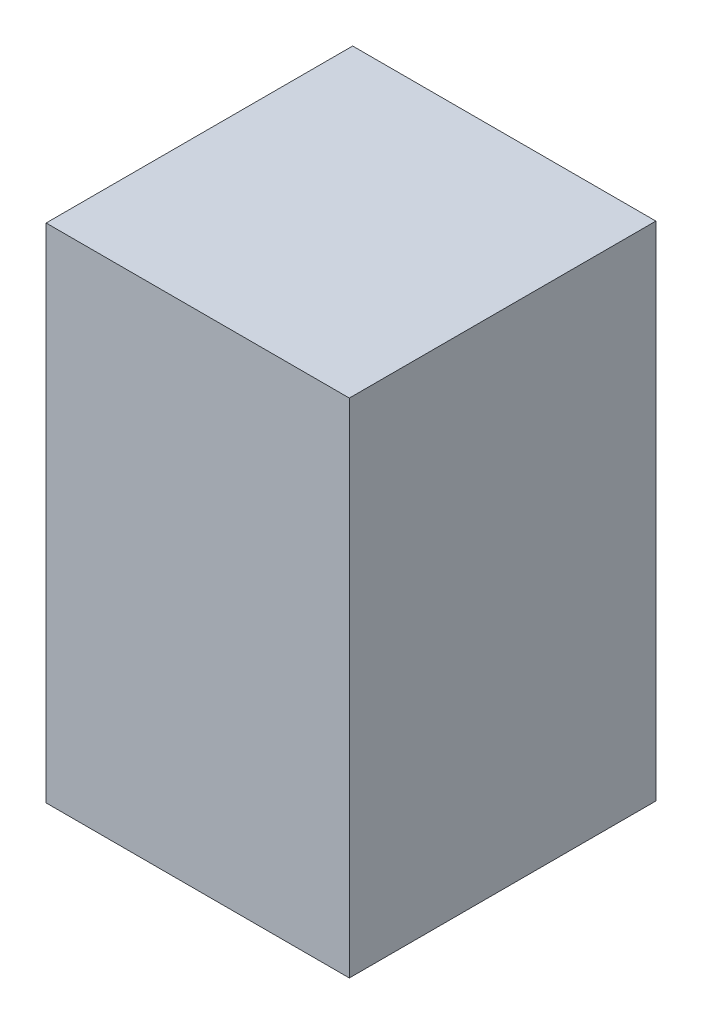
ISO-10303-21;
HEADER;
FILE_DESCRIPTION(('STEP AP214'),'2;1');
FILE_NAME('part.step','',(''),(''),'','','');
FILE_SCHEMA(('AUTOMOTIVE_DESIGN { 1 0 10303 214 1 1 1 1 }'));
ENDSEC;
DATA;
#1=APPLICATION_CONTEXT('core data for automotive mechanical design processes');
#2=APPLICATION_PROTOCOL_DEFINITION('international standard','automotive_design',2000,#1);
#3=PRODUCT_CONTEXT('',#1,'mechanical');
#4=PRODUCT('Part','Part','',(#3));
#5=PRODUCT_RELATED_PRODUCT_CATEGORY('part','',(#4));
#6=PRODUCT_DEFINITION_FORMATION('','',#4);
#7=PRODUCT_DEFINITION_CONTEXT('part definition',#1,'design');
#8=PRODUCT_DEFINITION('design','',#6,#7);
#9=PRODUCT_DEFINITION_SHAPE('','',#8);
#10=(LENGTH_UNIT() NAMED_UNIT(*) SI_UNIT(.MILLI.,.METRE.));
#11=(NAMED_UNIT(*) PLANE_ANGLE_UNIT() SI_UNIT($,.RADIAN.));
#12=(NAMED_UNIT(*) SI_UNIT($,.STERADIAN.) SOLID_ANGLE_UNIT());
#13=UNCERTAINTY_MEASURE_WITH_UNIT(LENGTH_MEASURE(1.E-05),#10,'distance_accuracy_value','');
#14=(GEOMETRIC_REPRESENTATION_CONTEXT(3) GLOBAL_UNCERTAINTY_ASSIGNED_CONTEXT((#13)) GLOBAL_UNIT_ASSIGNED_CONTEXT((#10,
#11,#12)) REPRESENTATION_CONTEXT('',''));
#15=CARTESIAN_POINT('',(0.,0.,0.));
#16=DIRECTION('',(0.,0.,1.));
#17=DIRECTION('',(1.,0.,0.));
#18=AXIS2_PLACEMENT_3D('',#15,#16,#17);
#19=CARTESIAN_POINT('',(0.,50.,0.));
#20=DIRECTION('',(1.,0.,0.));
#21=DIRECTION('',(0.,0.,-1.));
#22=AXIS2_PLACEMENT_3D('',#19,#20,#21);
#23=PLANE('',#22);
#24=DIRECTION('',(0.,0.,1.));
#25=VECTOR('',#24,1.);
#26=CARTESIAN_POINT('',(0.,0.,0.));
#27=LINE('',#26,#25);
#28=CARTESIAN_POINT('',(0.,0.,-30.5180599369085));
#29=VERTEX_POINT('',#28);
#30=CARTESIAN_POINT('',(0.,0.,0.));
#31=VERTEX_POINT('',#30);
#32=EDGE_CURVE('E75',#29,#31,#27,.T.);
#33=ORIENTED_EDGE('',*,*,#32,.T.);
#34=DIRECTION('',(0.,-1.,0.));
#35=VECTOR('',#34,1.);
#36=CARTESIAN_POINT('',(0.,50.,0.));
#37=LINE('',#36,#35);
#38=CARTESIAN_POINT('',(0.,50.,0.));
#39=VERTEX_POINT('',#38);
#40=EDGE_CURVE('E11',#39,#31,#37,.T.);
#41=ORIENTED_EDGE('',*,*,#40,.F.);
#42=DIRECTION('',(0.,0.,1.));
#43=VECTOR('',#42,1.);
#44=CARTESIAN_POINT('',(0.,50.,0.));
#45=LINE('',#44,#43);
#46=CARTESIAN_POINT('',(0.,50.,-30.5180599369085));
#47=VERTEX_POINT('',#46);
#48=EDGE_CURVE('E93',#47,#39,#45,.T.);
#49=ORIENTED_EDGE('',*,*,#48,.F.);
#50=DIRECTION('',(0.,-1.,0.));
#51=VECTOR('',#50,1.);
#52=CARTESIAN_POINT('',(0.,50.,-30.5180599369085));
#53=LINE('',#52,#51);
#54=EDGE_CURVE('E87',#47,#29,#53,.T.);
#55=ORIENTED_EDGE('',*,*,#54,.T.);
#56=EDGE_LOOP('',(#33,#41,#49,#55));
#57=FACE_BOUND('',#56,.T.);
#58=ADVANCED_FACE('F31',(#57),#23,.F.);
#59=CARTESIAN_POINT('',(0.,50.,0.));
#60=DIRECTION('',(0.,0.,-1.));
#61=DIRECTION('',(-1.,0.,0.));
#62=AXIS2_PLACEMENT_3D('',#59,#60,#61);
#63=PLANE('',#62);
#64=DIRECTION('',(1.,0.,0.));
#65=VECTOR('',#64,1.);
#66=CARTESIAN_POINT('',(0.,0.,0.));
#67=LINE('',#66,#65);
#68=CARTESIAN_POINT('',(30.1875394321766,0.,0.));
#69=VERTEX_POINT('',#68);
#70=EDGE_CURVE('E71',#31,#69,#67,.T.);
#71=ORIENTED_EDGE('',*,*,#70,.T.);
#72=DIRECTION('',(0.,-1.,0.));
#73=VECTOR('',#72,1.);
#74=CARTESIAN_POINT('',(30.1875394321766,50.,0.));
#75=LINE('',#74,#73);
#76=CARTESIAN_POINT('',(30.1875394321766,50.,0.));
#77=VERTEX_POINT('',#76);
#78=EDGE_CURVE('E38',#77,#69,#75,.T.);
#79=ORIENTED_EDGE('',*,*,#78,.F.);
#80=DIRECTION('',(1.,0.,0.));
#81=VECTOR('',#80,1.);
#82=CARTESIAN_POINT('',(0.,50.,0.));
#83=LINE('',#82,#81);
#84=EDGE_CURVE('E83',#39,#77,#83,.T.);
#85=ORIENTED_EDGE('',*,*,#84,.F.);
#86=ORIENTED_EDGE('',*,*,#40,.T.);
#87=EDGE_LOOP('',(#71,#79,#85,#86));
#88=FACE_BOUND('',#87,.T.);
#89=ADVANCED_FACE('F82',(#88),#63,.F.);
#90=CARTESIAN_POINT('',(30.1875394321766,50.,0.));
#91=DIRECTION('',(-1.,0.,0.));
#92=DIRECTION('',(0.,0.,1.));
#93=AXIS2_PLACEMENT_3D('',#90,#91,#92);
#94=PLANE('',#93);
#95=DIRECTION('',(0.,0.,-1.));
#96=VECTOR('',#95,1.);
#97=CARTESIAN_POINT('',(30.1875394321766,0.,0.));
#98=LINE('',#97,#96);
#99=CARTESIAN_POINT('',(30.1875394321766,0.,-30.5180599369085));
#100=VERTEX_POINT('',#99);
#101=EDGE_CURVE('E76',#69,#100,#98,.T.);
#102=ORIENTED_EDGE('',*,*,#101,.T.);
#103=DIRECTION('',(0.,-1.,0.));
#104=VECTOR('',#103,1.);
#105=CARTESIAN_POINT('',(30.1875394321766,50.,-30.5180599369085));
#106=LINE('',#105,#104);
#107=CARTESIAN_POINT('',(30.1875394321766,50.,-30.5180599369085));
#108=VERTEX_POINT('',#107);
#109=EDGE_CURVE('E99',#108,#100,#106,.T.);
#110=ORIENTED_EDGE('',*,*,#109,.F.);
#111=DIRECTION('',(0.,0.,-1.));
#112=VECTOR('',#111,1.);
#113=CARTESIAN_POINT('',(30.1875394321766,50.,0.));
#114=LINE('',#113,#112);
#115=EDGE_CURVE('E50',#77,#108,#114,.T.);
#116=ORIENTED_EDGE('',*,*,#115,.F.);
#117=ORIENTED_EDGE('',*,*,#78,.T.);
#118=EDGE_LOOP('',(#102,#110,#116,#117));
#119=FACE_BOUND('',#118,.T.);
#120=ADVANCED_FACE('F102',(#119),#94,.F.);
#121=CARTESIAN_POINT('',(0.,50.,-30.5180599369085));
#122=DIRECTION('',(0.,0.,1.));
#123=DIRECTION('',(1.,0.,0.));
#124=AXIS2_PLACEMENT_3D('',#121,#122,#123);
#125=PLANE('',#124);
#126=DIRECTION('',(-1.,0.,0.));
#127=VECTOR('',#126,1.);
#128=CARTESIAN_POINT('',(0.,0.,-30.5180599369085));
#129=LINE('',#128,#127);
#130=EDGE_CURVE('E91',#100,#29,#129,.T.);
#131=ORIENTED_EDGE('',*,*,#130,.T.);
#132=ORIENTED_EDGE('',*,*,#54,.F.);
#133=DIRECTION('',(-1.,0.,0.));
#134=VECTOR('',#133,1.);
#135=CARTESIAN_POINT('',(0.,50.,-30.5180599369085));
#136=LINE('',#135,#134);
#137=EDGE_CURVE('E45',#108,#47,#136,.T.);
#138=ORIENTED_EDGE('',*,*,#137,.F.);
#139=ORIENTED_EDGE('',*,*,#109,.T.);
#140=EDGE_LOOP('',(#131,#132,#138,#139));
#141=FACE_BOUND('',#140,.T.);
#142=ADVANCED_FACE('F104',(#141),#125,.F.);
#143=CARTESIAN_POINT('',(0.,50.,-30.5180599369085));
#144=DIRECTION('',(0.,-1.,0.));
#145=DIRECTION('',(0.,0.,-1.));
#146=AXIS2_PLACEMENT_3D('',#143,#144,#145);
#147=PLANE('',#146);
#148=ORIENTED_EDGE('',*,*,#48,.T.);
#149=ORIENTED_EDGE('',*,*,#84,.T.);
#150=ORIENTED_EDGE('',*,*,#115,.T.);
#151=ORIENTED_EDGE('',*,*,#137,.T.);
#152=EDGE_LOOP('',(#148,#149,#150,#151));
#153=FACE_BOUND('',#152,.T.);
#154=ADVANCED_FACE('F105',(#153),#147,.F.);
#155=CARTESIAN_POINT('',(0.,0.,-30.5180599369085));
#156=DIRECTION('',(0.,-1.,0.));
#157=DIRECTION('',(0.,0.,-1.));
#158=AXIS2_PLACEMENT_3D('',#155,#156,#157);
#159=PLANE('',#158);
#160=ORIENTED_EDGE('',*,*,#32,.F.);
#161=ORIENTED_EDGE('',*,*,#130,.F.);
#162=ORIENTED_EDGE('',*,*,#101,.F.);
#163=ORIENTED_EDGE('',*,*,#70,.F.);
#164=EDGE_LOOP('',(#160,#161,#162,#163));
#165=FACE_BOUND('',#164,.T.);
#166=ADVANCED_FACE('F72',(#165),#159,.T.);
#167=CLOSED_SHELL('',(#58,#89,#120,#142,#154,#166));
#168=MANIFOLD_SOLID_BREP('B2',#167);
#169=ADVANCED_BREP_SHAPE_REPRESENTATION('',(#18,#168),#14);
#170=SHAPE_DEFINITION_REPRESENTATION(#9,#169);
ENDSEC;
END-ISO-10303-21;
